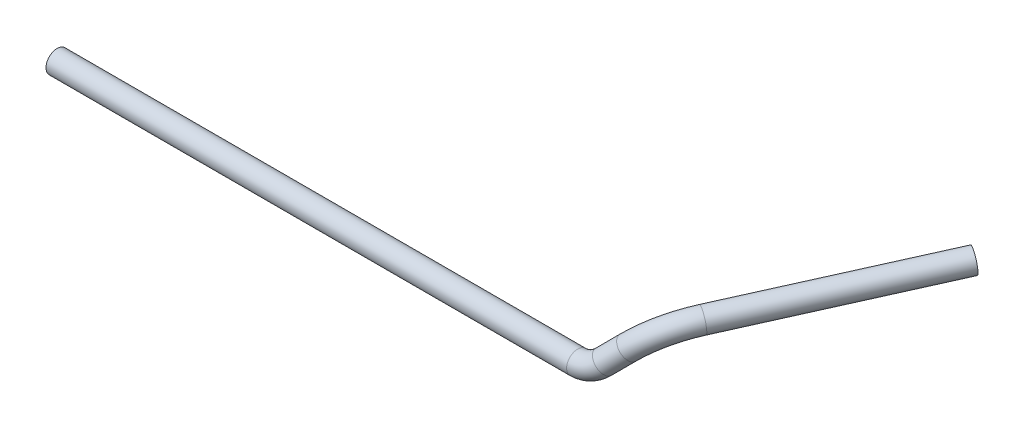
from build123d import *

# Parameters (mm, degrees)
SKIZZE1_R   = 4
SKIZZE1_R_2 = 3


with BuildPart() as part:
    # Austragung1: sweep along a curve in space
    with BuildLine() as austragung1_path:
        Line((-251.068191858, -24.098208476, 78.882835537), (-63.724951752, -24.098208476, 78.882835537))
        ThreePointArc((-63.724951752, -24.098208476, 78.882835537), (-59.487472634, -23.28723204, 78.474162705), (-55.994287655, -20.996747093, 77.319925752))
        Line((-55.994287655, -20.996747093, 77.319925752), (-50.20966502, -15.181650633, 74.389542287))
        ThreePointArc((-50.20966502, -15.181650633, 74.389542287), (-43.078419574, -9.279573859, 69.019894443), (-36.76157566, -6.524936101, 60.832602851))
        Line((0, 0, 0), (-36.76157566, -6.524936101, 60.832602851))
    # Skizze1 → Austragung1 (sweep)
    with BuildSketch(Plane(origin=(-251.068191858, 0, 0), x_dir=(0, 0, -1), z_dir=(1, 0, 0))):
        with Locations((-78.882835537, -24.098208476)):
            Circle(SKIZZE1_R)
        with Locations((-78.882835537, -24.098208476)):
            Circle(SKIZZE1_R_2, mode=Mode.SUBTRACT)
    sweep(path=austragung1_path.line)


solid = part.part
